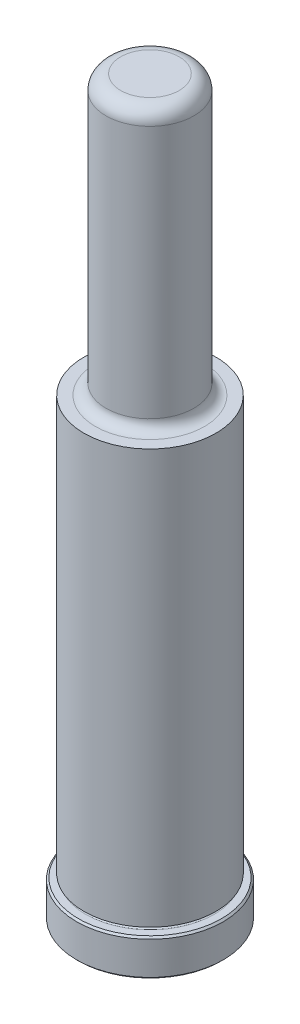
from build123d import *

# Parameters (mm, degrees)
CHAMFER1_SIZE = 0.381
FILLET7_R     = 3.175


with BuildPart() as part:
    # Sketch1 → Revolve1 (revolve)
    with BuildSketch(Plane(origin=(0, 0, 0), x_dir=(0, 0, -1), z_dir=(1, 0, 0)), mode=Mode.PRIVATE) as revolve1_sk:
        with BuildLine():
            Line((0, 0), (15.875, 0))
            Line((15.875, 0), (15.875, 7.9248))
            Line((15.875, 7.9248), (13.8938, 7.9248))
            ThreePointArc((13.8938, 7.9248), (13.5128, 8.3058), (13.8938, 8.6868))
            Line((13.8938, 8.6868), (14.3002, 8.6868))
            Line((14.3002, 8.6868), (14.3002, 98.425))
            Line((14.3002, 98.425), (11.7983, 98.425))
            ThreePointArc((11.7983, 98.425), (10.181853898, 99.094553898), (9.5123, 100.711))
            Line((9.5123, 100.711), (9.5123, 158.75))
            Line((9.5123, 158.75), (0, 158.75))
            Line((0, 158.75), (0, 0))
        make_face()
    revolve(revolve1_sk.sketch.rotate(Axis((0, 0, 0), (0, -1, 0)), 180), axis=Axis((0, 0, 0), (0, -1, 0)))

    # Chamfer1
    chamfer1_edges = [part.edges().sort_by_distance(p)[0] for p in [
        (0, 7.9248, -15.875),
        (0, 0, -15.875),
    ]]
    chamfer(chamfer1_edges, length=CHAMFER1_SIZE)

    # Fillet7
    fillet7_edges = [part.edges().sort_by_distance(p)[0] for p in [
        (0, 158.75, -9.5123),
    ]]
    fillet(fillet7_edges, radius=FILLET7_R)


solid = part.part
